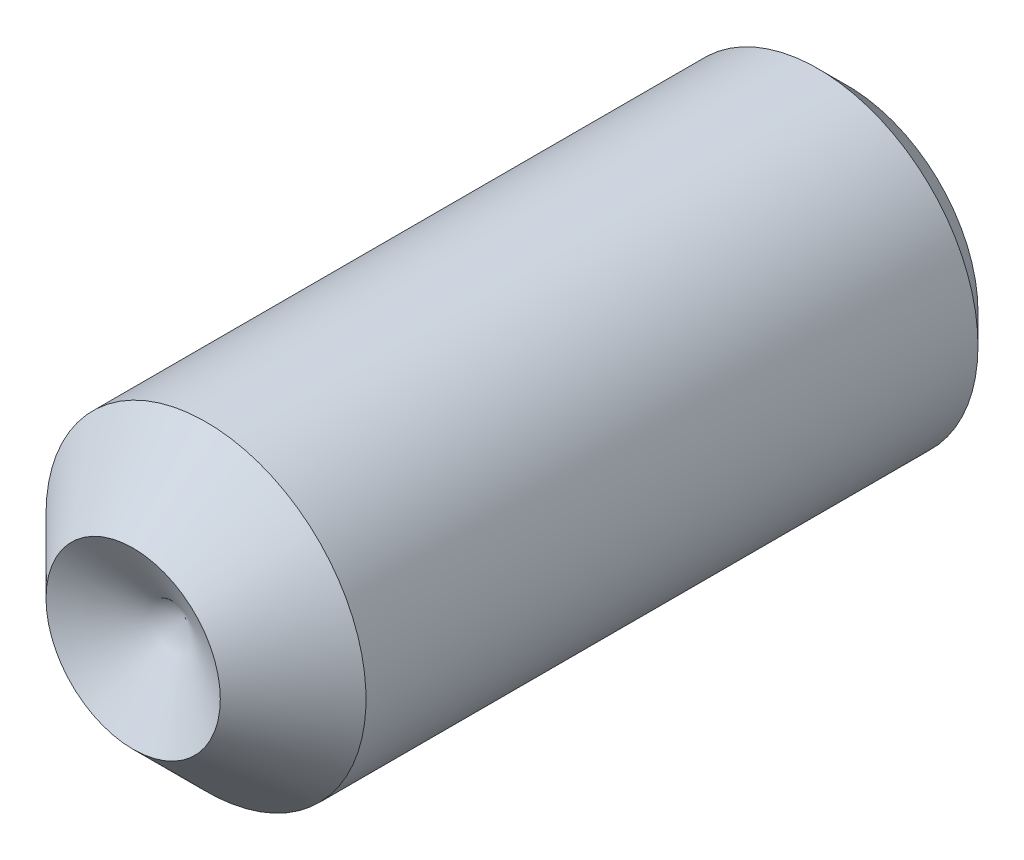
ISO-10303-21;
HEADER;
FILE_DESCRIPTION(('STEP AP214'),'2;1');
FILE_NAME('part.step','',(''),(''),'','','');
FILE_SCHEMA(('AUTOMOTIVE_DESIGN { 1 0 10303 214 1 1 1 1 }'));
ENDSEC;
DATA;
#1=APPLICATION_CONTEXT('core data for automotive mechanical design processes');
#2=APPLICATION_PROTOCOL_DEFINITION('international standard','automotive_design',2000,#1);
#3=PRODUCT_CONTEXT('',#1,'mechanical');
#4=PRODUCT('Part','Part','',(#3));
#5=PRODUCT_RELATED_PRODUCT_CATEGORY('part','',(#4));
#6=PRODUCT_DEFINITION_FORMATION('','',#4);
#7=PRODUCT_DEFINITION_CONTEXT('part definition',#1,'design');
#8=PRODUCT_DEFINITION('design','',#6,#7);
#9=PRODUCT_DEFINITION_SHAPE('','',#8);
#10=(LENGTH_UNIT() NAMED_UNIT(*) SI_UNIT(.MILLI.,.METRE.));
#11=(NAMED_UNIT(*) PLANE_ANGLE_UNIT() SI_UNIT($,.RADIAN.));
#12=(NAMED_UNIT(*) SI_UNIT($,.STERADIAN.) SOLID_ANGLE_UNIT());
#13=UNCERTAINTY_MEASURE_WITH_UNIT(LENGTH_MEASURE(1.E-05),#10,'distance_accuracy_value','');
#14=(GEOMETRIC_REPRESENTATION_CONTEXT(3) GLOBAL_UNCERTAINTY_ASSIGNED_CONTEXT((#13)) GLOBAL_UNIT_ASSIGNED_CONTEXT((#10,
#11,#12)) REPRESENTATION_CONTEXT('',''));
#15=CARTESIAN_POINT('',(0.,0.,0.));
#16=DIRECTION('',(0.,0.,1.));
#17=DIRECTION('',(1.,0.,0.));
#18=AXIS2_PLACEMENT_3D('',#15,#16,#17);
#19=CARTESIAN_POINT('',(0.,0.,6.34999999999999));
#20=DIRECTION('',(0.,0.,-0.999999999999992));
#21=DIRECTION('',(-1.,0.,0.));
#22=AXIS2_PLACEMENT_3D('',#19,#20,#21);
#23=CYLINDRICAL_SURFACE('',#22,1.4224);
#24=CARTESIAN_POINT('',(0.,0.,0.262466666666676));
#25=DIRECTION('',(0.,0.,0.999999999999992));
#26=DIRECTION('',(1.,0.,0.));
#27=AXIS2_PLACEMENT_3D('',#24,#25,#26);
#28=CIRCLE('',#27,1.4224);
#29=CARTESIAN_POINT('',(-1.42239999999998,0.,0.262466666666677));
#30=VERTEX_POINT('',#29);
#31=EDGE_CURVE('E43',#30,#30,#28,.T.);
#32=CARTESIAN_POINT('',(0.,0.,5.70229999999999));
#33=DIRECTION('',(0.,0.,-0.999999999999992));
#34=DIRECTION('',(-1.,0.,0.));
#35=AXIS2_PLACEMENT_3D('',#32,#33,#34);
#36=CIRCLE('',#35,1.4224);
#37=CARTESIAN_POINT('',(-1.42239999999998,0.,5.70229999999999));
#38=VERTEX_POINT('',#37);
#39=EDGE_CURVE('E145',#38,#38,#36,.T.);
#40=CARTESIAN_POINT('',(-1.42239999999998,0.,0.262466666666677));
#41=CARTESIAN_POINT('',(-1.42239999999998,0.,0.319131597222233));
#42=CARTESIAN_POINT('',(-1.42239999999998,0.,0.375796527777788));
#43=CARTESIAN_POINT('',(-1.42239999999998,0.,0.489126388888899));
#44=CARTESIAN_POINT('',(-1.42239999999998,0.,0.545791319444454));
#45=CARTESIAN_POINT('',(-1.42239999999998,0.,0.659121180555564));
#46=CARTESIAN_POINT('',(-1.42239999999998,0.,0.71578611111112));
#47=CARTESIAN_POINT('',(-1.42239999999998,0.,0.829115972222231));
#48=CARTESIAN_POINT('',(-1.42239999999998,0.,0.885780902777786));
#49=CARTESIAN_POINT('',(-1.42239999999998,0.,0.999110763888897));
#50=CARTESIAN_POINT('',(-1.42239999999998,0.,1.05577569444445));
#51=CARTESIAN_POINT('',(-1.42239999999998,0.,1.16910555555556));
#52=CARTESIAN_POINT('',(-1.42239999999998,0.,1.22577048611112));
#53=CARTESIAN_POINT('',(-1.42239999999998,0.,1.33910034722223));
#54=CARTESIAN_POINT('',(-1.42239999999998,0.,1.39576527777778));
#55=CARTESIAN_POINT('',(-1.42239999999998,0.,1.5090951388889));
#56=CARTESIAN_POINT('',(-1.42239999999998,0.,1.56576006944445));
#57=CARTESIAN_POINT('',(-1.42239999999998,0.,1.67908993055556));
#58=CARTESIAN_POINT('',(-1.42239999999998,0.,1.73575486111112));
#59=CARTESIAN_POINT('',(-1.42239999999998,0.,1.84908472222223));
#60=CARTESIAN_POINT('',(-1.42239999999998,0.,1.90574965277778));
#61=CARTESIAN_POINT('',(-1.42239999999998,0.,2.01907951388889));
#62=CARTESIAN_POINT('',(-1.42239999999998,0.,2.07574444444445));
#63=CARTESIAN_POINT('',(-1.42239999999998,0.,2.18907430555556));
#64=CARTESIAN_POINT('',(-1.42239999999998,0.,2.24573923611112));
#65=CARTESIAN_POINT('',(-1.42239999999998,0.,2.35906909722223));
#66=CARTESIAN_POINT('',(-1.42239999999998,0.,2.41573402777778));
#67=CARTESIAN_POINT('',(-1.42239999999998,0.,2.52906388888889));
#68=CARTESIAN_POINT('',(-1.42239999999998,0.,2.58572881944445));
#69=CARTESIAN_POINT('',(-1.42239999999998,0.,2.69905868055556));
#70=CARTESIAN_POINT('',(-1.42239999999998,0.,2.75572361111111));
#71=CARTESIAN_POINT('',(-1.42239999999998,0.,2.86905347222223));
#72=CARTESIAN_POINT('',(-1.42239999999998,0.,2.92571840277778));
#73=CARTESIAN_POINT('',(-1.42239999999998,0.,3.03904826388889));
#74=CARTESIAN_POINT('',(-1.42239999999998,0.,3.09571319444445));
#75=CARTESIAN_POINT('',(-1.42239999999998,0.,3.20904305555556));
#76=CARTESIAN_POINT('',(-1.42239999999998,0.,3.26570798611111));
#77=CARTESIAN_POINT('',(-1.42239999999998,0.,3.37903784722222));
#78=CARTESIAN_POINT('',(-1.42239999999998,0.,3.43570277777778));
#79=CARTESIAN_POINT('',(-1.42239999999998,0.,3.54903263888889));
#80=CARTESIAN_POINT('',(-1.42239999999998,0.,3.60569756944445));
#81=CARTESIAN_POINT('',(-1.42239999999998,0.,3.71902743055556));
#82=CARTESIAN_POINT('',(-1.42239999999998,0.,3.77569236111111));
#83=CARTESIAN_POINT('',(-1.42239999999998,0.,3.88902222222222));
#84=CARTESIAN_POINT('',(-1.42239999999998,0.,3.94568715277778));
#85=CARTESIAN_POINT('',(-1.42239999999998,0.,4.05901701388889));
#86=CARTESIAN_POINT('',(-1.42239999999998,0.,4.11568194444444));
#87=CARTESIAN_POINT('',(-1.42239999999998,0.,4.22901180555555));
#88=CARTESIAN_POINT('',(-1.42239999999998,0.,4.28567673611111));
#89=CARTESIAN_POINT('',(-1.42239999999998,0.,4.39900659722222));
#90=CARTESIAN_POINT('',(-1.42239999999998,0.,4.45567152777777));
#91=CARTESIAN_POINT('',(-1.42239999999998,0.,4.56900138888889));
#92=CARTESIAN_POINT('',(-1.42239999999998,0.,4.62566631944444));
#93=CARTESIAN_POINT('',(-1.42239999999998,0.,4.73899618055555));
#94=CARTESIAN_POINT('',(-1.42239999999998,0.,4.79566111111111));
#95=CARTESIAN_POINT('',(-1.42239999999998,0.,4.90899097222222));
#96=CARTESIAN_POINT('',(-1.42239999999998,0.,4.96565590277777));
#97=CARTESIAN_POINT('',(-1.42239999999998,0.,5.07898576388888));
#98=CARTESIAN_POINT('',(-1.42239999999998,0.,5.13565069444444));
#99=CARTESIAN_POINT('',(-1.42239999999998,0.,5.24898055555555));
#100=CARTESIAN_POINT('',(-1.42239999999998,0.,5.30564548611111));
#101=CARTESIAN_POINT('',(-1.42239999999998,0.,5.41897534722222));
#102=CARTESIAN_POINT('',(-1.42239999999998,0.,5.47564027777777));
#103=CARTESIAN_POINT('',(-1.42239999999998,0.,5.58897013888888));
#104=CARTESIAN_POINT('',(-1.42239999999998,0.,5.64563506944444));
#105=CARTESIAN_POINT('',(-1.42239999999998,0.,5.70229999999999));
#106=B_SPLINE_CURVE_WITH_KNOTS('',3,(#40,#41,#42,#43,#44,#45,#46,#47,#48,#49,#50,#51,#52,#53,
#54,#55,#56,#57,#58,#59,#60,#61,#62,#63,#64,#65,#66,#67,#68,#69,#70,#71,#72,#73,#74,#75,#76,#77,
#78,#79,#80,#81,#82,#83,#84,#85,#86,#87,#88,#89,#90,#91,#92,#93,#94,#95,#96,#97,#98,#99,#100,
#101,#102,#103,#104,#105),.UNSPECIFIED.,.F.,.F.,(4,2,2,2,2,2,2,2,2,2,2,2,2,2,2,2,2,2,2,2,2,2,2,
2,2,2,2,2,2,2,2,2,4),(0.,0.169994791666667,0.339989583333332,0.509984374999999,
0.679979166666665,0.849973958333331,1.01996875,1.18996354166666,1.35995833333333,1.529953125,
1.69994791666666,1.86994270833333,2.03993749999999,2.20993229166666,2.37992708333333,
2.54992187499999,2.71991666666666,2.88991145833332,3.05990624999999,3.22990104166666,
3.39989583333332,3.56989062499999,3.73988541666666,3.90988020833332,4.07987499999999,
4.24986979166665,4.41986458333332,4.58985937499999,4.75985416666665,4.92984895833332,
5.09984374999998,5.26983854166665,5.43983333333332),.UNSPECIFIED.);
#107=EDGE_CURVE('BSEAM36',#30,#38,#106,.T.);
#108=ORIENTED_EDGE('',*,*,#31,.T.);
#109=ORIENTED_EDGE('',*,*,#39,.T.);
#110=ORIENTED_EDGE('',*,*,#107,.T.);
#111=ORIENTED_EDGE('',*,*,#107,.F.);
#112=EDGE_LOOP('',(#108,#110,#109,#111));
#113=FACE_BOUND('',#112,.T.);
#114=ADVANCED_FACE('F36',(#113),#23,.T.);
#115=CARTESIAN_POINT('',(0.,0.,0.));
#116=DIRECTION('',(0.,0.,0.999999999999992));
#117=DIRECTION('',(1.,0.,0.));
#118=AXIS2_PLACEMENT_3D('',#115,#116,#117);
#119=PLANE('',#118);
#120=CARTESIAN_POINT('',(0.,0.,0.));
#121=DIRECTION('',(0.,0.,0.999999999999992));
#122=DIRECTION('',(1.,0.,0.));
#123=AXIS2_PLACEMENT_3D('',#120,#121,#122);
#124=CIRCLE('',#123,1.15993333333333);
#125=CARTESIAN_POINT('',(1.15993333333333,0.,0.));
#126=VERTEX_POINT('',#125);
#127=EDGE_CURVE('E11',#126,#126,#124,.F.);
#128=ORIENTED_EDGE('',*,*,#127,.T.);
#129=EDGE_LOOP('',(#128));
#130=FACE_BOUND('',#129,.T.);
#131=DIRECTION('',(-0.866025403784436,-0.499999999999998,0.));
#132=VECTOR('',#131,1.);
#133=CARTESIAN_POINT('',(0.,0.733234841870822,0.));
#134=LINE('',#133,#132);
#135=CARTESIAN_POINT('',(0.,0.733234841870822,0.));
#136=VERTEX_POINT('',#135);
#137=CARTESIAN_POINT('',(-0.635000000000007,0.366617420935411,0.));
#138=VERTEX_POINT('',#137);
#139=EDGE_CURVE('E104',#136,#138,#134,.T.);
#140=ORIENTED_EDGE('',*,*,#139,.T.);
#141=DIRECTION('',(0.,0.999999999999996,0.));
#142=VECTOR('',#141,1.);
#143=CARTESIAN_POINT('',(-0.635000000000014,-0.366617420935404,0.));
#144=LINE('',#143,#142);
#145=CARTESIAN_POINT('',(-0.635000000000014,-0.366617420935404,0.));
#146=VERTEX_POINT('',#145);
#147=EDGE_CURVE('E50',#146,#138,#144,.T.);
#148=ORIENTED_EDGE('',*,*,#147,.F.);
#149=DIRECTION('',(-0.866025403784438,0.5,0.));
#150=VECTOR('',#149,1.);
#151=CARTESIAN_POINT('',(0.,-0.733234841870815,0.));
#152=LINE('',#151,#150);
#153=CARTESIAN_POINT('',(0.,-0.733234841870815,0.));
#154=VERTEX_POINT('',#153);
#155=EDGE_CURVE('E118',#154,#146,#152,.T.);
#156=ORIENTED_EDGE('',*,*,#155,.F.);
#157=DIRECTION('',(0.866025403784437,0.499999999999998,0.));
#158=VECTOR('',#157,1.);
#159=CARTESIAN_POINT('',(0.,-0.733234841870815,0.));
#160=LINE('',#159,#158);
#161=CARTESIAN_POINT('',(0.634999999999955,-0.36661742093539,0.));
#162=VERTEX_POINT('',#161);
#163=EDGE_CURVE('E113',#154,#162,#160,.T.);
#164=ORIENTED_EDGE('',*,*,#163,.T.);
#165=DIRECTION('',(0.,0.999999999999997,0.));
#166=VECTOR('',#165,1.);
#167=CARTESIAN_POINT('',(0.634999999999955,-0.36661742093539,0.));
#168=LINE('',#167,#166);
#169=CARTESIAN_POINT('',(0.634999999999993,0.366617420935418,0.));
#170=VERTEX_POINT('',#169);
#171=EDGE_CURVE('E111',#162,#170,#168,.T.);
#172=ORIENTED_EDGE('',*,*,#171,.T.);
#173=DIRECTION('',(0.866025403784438,-0.5,0.));
#174=VECTOR('',#173,1.);
#175=CARTESIAN_POINT('',(0.,0.733234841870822,0.));
#176=LINE('',#175,#174);
#177=EDGE_CURVE('E94',#136,#170,#176,.T.);
#178=ORIENTED_EDGE('',*,*,#177,.F.);
#179=EDGE_LOOP('',(#140,#148,#156,#164,#172,#178));
#180=FACE_BOUND('',#179,.T.);
#181=ADVANCED_FACE('F108',(#130,#180),#119,.F.);
#182=CARTESIAN_POINT('',(0.,0.,6.34999999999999));
#183=DIRECTION('',(0.,0.,-0.999999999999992));
#184=DIRECTION('',(-1.,0.,0.));
#185=AXIS2_PLACEMENT_3D('',#182,#183,#184);
#186=CONICAL_SURFACE('',#185,0.7747,0.785398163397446);
#187=CARTESIAN_POINT('',(0.,0.,6.34999999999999));
#188=DIRECTION('',(0.,0.,-0.999999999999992));
#189=DIRECTION('',(-1.,0.,0.));
#190=AXIS2_PLACEMENT_3D('',#187,#188,#189);
#191=CIRCLE('',#190,0.7747);
#192=CARTESIAN_POINT('',(-0.774699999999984,0.,6.34999999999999));
#193=VERTEX_POINT('',#192);
#194=EDGE_CURVE('E136',#193,#193,#191,.T.);
#195=CARTESIAN_POINT('',(-1.42239999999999,0.,5.70229999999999));
#196=CARTESIAN_POINT('',(-1.41565312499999,0.,5.70904687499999));
#197=CARTESIAN_POINT('',(-1.40890624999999,0.,5.71579374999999));
#198=CARTESIAN_POINT('',(-1.39541249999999,0.,5.72928749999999));
#199=CARTESIAN_POINT('',(-1.38866562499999,0.,5.73603437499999));
#200=CARTESIAN_POINT('',(-1.37517187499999,0.,5.74952812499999));
#201=CARTESIAN_POINT('',(-1.36842499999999,0.,5.756275));
#202=CARTESIAN_POINT('',(-1.35493124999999,0.,5.76976874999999));
#203=CARTESIAN_POINT('',(-1.34818437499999,0.,5.77651562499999));
#204=CARTESIAN_POINT('',(-1.33469062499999,0.,5.79000937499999));
#205=CARTESIAN_POINT('',(-1.32794374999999,0.,5.79675625));
#206=CARTESIAN_POINT('',(-1.31444999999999,0.,5.81024999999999));
#207=CARTESIAN_POINT('',(-1.30770312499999,0.,5.81699687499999));
#208=CARTESIAN_POINT('',(-1.29420937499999,0.,5.83049062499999));
#209=CARTESIAN_POINT('',(-1.28746249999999,0.,5.8372375));
#210=CARTESIAN_POINT('',(-1.27396874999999,0.,5.85073124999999));
#211=CARTESIAN_POINT('',(-1.26722187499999,0.,5.85747812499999));
#212=CARTESIAN_POINT('',(-1.25372812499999,0.,5.87097187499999));
#213=CARTESIAN_POINT('',(-1.24698124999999,0.,5.87771875));
#214=CARTESIAN_POINT('',(-1.23348749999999,0.,5.89121249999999));
#215=CARTESIAN_POINT('',(-1.22674062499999,0.,5.89795937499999));
#216=CARTESIAN_POINT('',(-1.21324687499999,0.,5.91145312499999));
#217=CARTESIAN_POINT('',(-1.20649999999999,0.,5.9182));
#218=CARTESIAN_POINT('',(-1.19300624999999,0.,5.93169374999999));
#219=CARTESIAN_POINT('',(-1.18625937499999,0.,5.93844062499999));
#220=CARTESIAN_POINT('',(-1.17276562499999,0.,5.95193437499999));
#221=CARTESIAN_POINT('',(-1.16601874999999,0.,5.95868125));
#222=CARTESIAN_POINT('',(-1.15252499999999,0.,5.97217499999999));
#223=CARTESIAN_POINT('',(-1.14577812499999,0.,5.97892187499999));
#224=CARTESIAN_POINT('',(-1.13228437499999,0.,5.99241562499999));
#225=CARTESIAN_POINT('',(-1.12553749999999,0.,5.9991625));
#226=CARTESIAN_POINT('',(-1.11204374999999,0.,6.01265624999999));
#227=CARTESIAN_POINT('',(-1.10529687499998,0.,6.01940312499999));
#228=CARTESIAN_POINT('',(-1.09180312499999,0.,6.03289687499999));
#229=CARTESIAN_POINT('',(-1.08505624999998,0.,6.03964375));
#230=CARTESIAN_POINT('',(-1.07156249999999,0.,6.05313749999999));
#231=CARTESIAN_POINT('',(-1.06481562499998,0.,6.05988437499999));
#232=CARTESIAN_POINT('',(-1.05132187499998,0.,6.07337812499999));
#233=CARTESIAN_POINT('',(-1.04457499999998,0.,6.080125));
#234=CARTESIAN_POINT('',(-1.03108124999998,0.,6.09361874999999));
#235=CARTESIAN_POINT('',(-1.02433437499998,0.,6.10036562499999));
#236=CARTESIAN_POINT('',(-1.01084062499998,0.,6.11385937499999));
#237=CARTESIAN_POINT('',(-1.00409374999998,0.,6.12060625));
#238=CARTESIAN_POINT('',(-0.990599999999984,0.,6.13409999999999));
#239=CARTESIAN_POINT('',(-0.983853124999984,0.,6.14084687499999));
#240=CARTESIAN_POINT('',(-0.970359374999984,0.,6.15434062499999));
#241=CARTESIAN_POINT('',(-0.963612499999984,0.,6.16108749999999));
#242=CARTESIAN_POINT('',(-0.950118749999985,0.,6.17458125));
#243=CARTESIAN_POINT('',(-0.943371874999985,0.,6.181328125));
#244=CARTESIAN_POINT('',(-0.929878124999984,0.,6.194821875));
#245=CARTESIAN_POINT('',(-0.923131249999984,0.,6.20156874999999));
#246=CARTESIAN_POINT('',(-0.909637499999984,0.,6.21506249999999));
#247=CARTESIAN_POINT('',(-0.902890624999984,0.,6.22180937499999));
#248=CARTESIAN_POINT('',(-0.889396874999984,0.,6.235303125));
#249=CARTESIAN_POINT('',(-0.882649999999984,0.,6.24205));
#250=CARTESIAN_POINT('',(-0.869156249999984,0.,6.25554374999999));
#251=CARTESIAN_POINT('',(-0.862409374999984,0.,6.262290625));
#252=CARTESIAN_POINT('',(-0.848915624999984,0.,6.275784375));
#253=CARTESIAN_POINT('',(-0.842168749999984,0.,6.28253124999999));
#254=CARTESIAN_POINT('',(-0.828674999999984,0.,6.29602499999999));
#255=CARTESIAN_POINT('',(-0.821928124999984,0.,6.302771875));
#256=CARTESIAN_POINT('',(-0.808434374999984,0.,6.31626562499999));
#257=CARTESIAN_POINT('',(-0.801687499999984,0.,6.32301249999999));
#258=CARTESIAN_POINT('',(-0.788193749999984,0.,6.33650624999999));
#259=CARTESIAN_POINT('',(-0.781446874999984,0.,6.343253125));
#260=CARTESIAN_POINT('',(-0.774699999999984,0.,6.34999999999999));
#261=B_SPLINE_CURVE_WITH_KNOTS('',3,(#195,#196,#197,#198,#199,#200,#201,#202,#203,#204,#205,
#206,#207,#208,#209,#210,#211,#212,#213,#214,#215,#216,#217,#218,#219,#220,#221,#222,#223,#224,
#225,#226,#227,#228,#229,#230,#231,#232,#233,#234,#235,#236,#237,#238,#239,#240,#241,#242,#243,
#244,#245,#246,#247,#248,#249,#250,#251,#252,#253,#254,#255,#256,#257,#258,#259,#260),
.UNSPECIFIED.,.F.,.F.,(4,2,2,2,2,2,2,2,2,2,2,2,2,2,2,2,2,2,2,2,2,2,2,2,2,2,2,2,2,2,2,2,4),(0.,
0.028624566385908,0.0572491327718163,0.0858736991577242,0.114498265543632,0.14312283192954,
0.171747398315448,0.200371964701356,0.228996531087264,0.257621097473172,0.28624566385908,
0.314870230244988,0.343494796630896,0.372119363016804,0.400743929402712,0.429368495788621,
0.457993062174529,0.486617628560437,0.515242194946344,0.543866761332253,0.572491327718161,
0.601115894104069,0.629740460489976,0.658365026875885,0.686989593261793,0.7156141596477,
0.744238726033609,0.772863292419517,0.801487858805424,0.830112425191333,0.85873699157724,
0.887361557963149,0.915986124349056),.UNSPECIFIED.);
#262=EDGE_CURVE('BSEAM167',#38,#193,#261,.T.);
#263=ORIENTED_EDGE('',*,*,#39,.F.);
#264=ORIENTED_EDGE('',*,*,#194,.T.);
#265=ORIENTED_EDGE('',*,*,#262,.T.);
#266=ORIENTED_EDGE('',*,*,#262,.F.);
#267=EDGE_LOOP('',(#263,#265,#264,#266));
#268=FACE_BOUND('',#267,.T.);
#269=ADVANCED_FACE('F167',(#268),#186,.T.);
#270=CARTESIAN_POINT('',(0.,0.,5.88451327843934));
#271=DIRECTION('',(0.,0.,0.999999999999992));
#272=DIRECTION('',(1.,0.,0.));
#273=AXIS2_PLACEMENT_3D('',#270,#271,#272);
#274=CONICAL_SURFACE('',#273,0.,1.02974425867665);
#275=ORIENTED_EDGE('',*,*,#194,.F.);
#276=EDGE_LOOP('',(#275));
#277=FACE_BOUND('',#276,.T.);
#278=CARTESIAN_POINT('',(0.,0.,5.88451327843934));
#279=VERTEX_POINT('',#278);
#280=VERTEX_LOOP('',#279);
#281=FACE_BOUND('',#280,.T.);
#282=ADVANCED_FACE('F172',(#277,#281),#274,.F.);
#283=CARTESIAN_POINT('',(-0.635000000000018,-0.36661742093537,1.27));
#284=DIRECTION('',(-0.999999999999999,0.,0.));
#285=DIRECTION('',(0.,-0.999999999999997,0.));
#286=AXIS2_PLACEMENT_3D('',#283,#284,#285);
#287=PLANE('',#286);
#288=ORIENTED_EDGE('',*,*,#147,.T.);
#289=DIRECTION('',(0.,0.,-0.999999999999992));
#290=VECTOR('',#289,1.);
#291=CARTESIAN_POINT('',(-0.635000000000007,0.366617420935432,1.27));
#292=LINE('',#291,#290);
#293=CARTESIAN_POINT('',(-0.635000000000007,0.366617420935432,1.27));
#294=VERTEX_POINT('',#293);
#295=EDGE_CURVE('E101',#294,#138,#292,.T.);
#296=ORIENTED_EDGE('',*,*,#295,.F.);
#297=DIRECTION('',(0.,0.999999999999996,0.));
#298=VECTOR('',#297,1.);
#299=CARTESIAN_POINT('',(-0.635000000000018,-0.36661742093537,1.27));
#300=LINE('',#299,#298);
#301=CARTESIAN_POINT('',(-0.635000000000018,-0.36661742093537,1.27));
#302=VERTEX_POINT('',#301);
#303=EDGE_CURVE('E121',#302,#294,#300,.T.);
#304=ORIENTED_EDGE('',*,*,#303,.F.);
#305=DIRECTION('',(0.,0.,-0.999999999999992));
#306=VECTOR('',#305,1.);
#307=CARTESIAN_POINT('',(-0.635000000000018,-0.36661742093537,1.27));
#308=LINE('',#307,#306);
#309=EDGE_CURVE('E134',#302,#146,#308,.T.);
#310=ORIENTED_EDGE('',*,*,#309,.T.);
#311=EDGE_LOOP('',(#288,#296,#304,#310));
#312=FACE_BOUND('',#311,.T.);
#313=ADVANCED_FACE('F178',(#312),#287,.F.);
#314=CARTESIAN_POINT('',(0.,-0.733234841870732,1.27));
#315=DIRECTION('',(-0.499999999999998,-0.866025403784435,0.));
#316=DIRECTION('',(0.866025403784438,-0.5,0.));
#317=AXIS2_PLACEMENT_3D('',#314,#315,#316);
#318=PLANE('',#317);
#319=ORIENTED_EDGE('',*,*,#155,.T.);
#320=ORIENTED_EDGE('',*,*,#309,.F.);
#321=DIRECTION('',(-0.866025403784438,0.5,0.));
#322=VECTOR('',#321,1.);
#323=CARTESIAN_POINT('',(0.,-0.733234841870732,1.27));
#324=LINE('',#323,#322);
#325=CARTESIAN_POINT('',(0.,-0.733234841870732,1.27));
#326=VERTEX_POINT('',#325);
#327=EDGE_CURVE('E131',#326,#302,#324,.T.);
#328=ORIENTED_EDGE('',*,*,#327,.F.);
#329=DIRECTION('',(0.,0.,-0.999999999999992));
#330=VECTOR('',#329,1.);
#331=CARTESIAN_POINT('',(0.,-0.733234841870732,1.27));
#332=LINE('',#331,#330);
#333=EDGE_CURVE('E137',#326,#154,#332,.T.);
#334=ORIENTED_EDGE('',*,*,#333,.T.);
#335=EDGE_LOOP('',(#319,#320,#328,#334));
#336=FACE_BOUND('',#335,.T.);
#337=ADVANCED_FACE('F182',(#336),#318,.F.);
#338=CARTESIAN_POINT('',(0.,-0.733234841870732,1.27));
#339=DIRECTION('',(-0.500000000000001,0.866025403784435,0.));
#340=DIRECTION('',(-0.866025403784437,-0.499999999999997,0.));
#341=AXIS2_PLACEMENT_3D('',#338,#339,#340);
#342=PLANE('',#341);
#343=ORIENTED_EDGE('',*,*,#163,.F.);
#344=ORIENTED_EDGE('',*,*,#333,.F.);
#345=DIRECTION('',(0.866025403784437,0.499999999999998,0.));
#346=VECTOR('',#345,1.);
#347=CARTESIAN_POINT('',(0.,-0.733234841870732,1.27));
#348=LINE('',#347,#346);
#349=CARTESIAN_POINT('',(0.634999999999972,-0.366617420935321,1.27000000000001));
#350=VERTEX_POINT('',#349);
#351=EDGE_CURVE('E129',#326,#350,#348,.T.);
#352=ORIENTED_EDGE('',*,*,#351,.T.);
#353=DIRECTION('',(0.,0.,-0.999999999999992));
#354=VECTOR('',#353,1.);
#355=CARTESIAN_POINT('',(0.634999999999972,-0.366617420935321,1.27000000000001));
#356=LINE('',#355,#354);
#357=EDGE_CURVE('E139',#350,#162,#356,.T.);
#358=ORIENTED_EDGE('',*,*,#357,.T.);
#359=EDGE_LOOP('',(#343,#344,#352,#358));
#360=FACE_BOUND('',#359,.T.);
#361=ADVANCED_FACE('F190',(#360),#342,.T.);
#362=CARTESIAN_POINT('',(0.634999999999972,-0.366617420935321,1.27000000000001));
#363=DIRECTION('',(-1.,0.,0.));
#364=DIRECTION('',(0.,-0.999999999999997,0.));
#365=AXIS2_PLACEMENT_3D('',#362,#363,#364);
#366=PLANE('',#365);
#367=ORIENTED_EDGE('',*,*,#171,.F.);
#368=ORIENTED_EDGE('',*,*,#357,.F.);
#369=DIRECTION('',(0.,0.999999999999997,0.));
#370=VECTOR('',#369,1.);
#371=CARTESIAN_POINT('',(0.634999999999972,-0.366617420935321,1.27000000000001));
#372=LINE('',#371,#370);
#373=CARTESIAN_POINT('',(0.634999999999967,0.366617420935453,1.26999999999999));
#374=VERTEX_POINT('',#373);
#375=EDGE_CURVE('E127',#350,#374,#372,.T.);
#376=ORIENTED_EDGE('',*,*,#375,.T.);
#377=DIRECTION('',(0.,0.,-0.999999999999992));
#378=VECTOR('',#377,1.);
#379=CARTESIAN_POINT('',(0.634999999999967,0.366617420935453,1.26999999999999));
#380=LINE('',#379,#378);
#381=EDGE_CURVE('E100',#374,#170,#380,.T.);
#382=ORIENTED_EDGE('',*,*,#381,.T.);
#383=EDGE_LOOP('',(#367,#368,#376,#382));
#384=FACE_BOUND('',#383,.T.);
#385=ADVANCED_FACE('F187',(#384),#366,.T.);
#386=CARTESIAN_POINT('',(0.,0.733234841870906,1.27));
#387=DIRECTION('',(0.499999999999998,0.866025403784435,0.));
#388=DIRECTION('',(-0.866025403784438,0.5,0.));
#389=AXIS2_PLACEMENT_3D('',#386,#387,#388);
#390=PLANE('',#389);
#391=ORIENTED_EDGE('',*,*,#177,.T.);
#392=ORIENTED_EDGE('',*,*,#381,.F.);
#393=DIRECTION('',(0.866025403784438,-0.5,0.));
#394=VECTOR('',#393,1.);
#395=CARTESIAN_POINT('',(0.,0.733234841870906,1.27));
#396=LINE('',#395,#394);
#397=CARTESIAN_POINT('',(0.,0.733234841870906,1.27));
#398=VERTEX_POINT('',#397);
#399=EDGE_CURVE('E97',#398,#374,#396,.T.);
#400=ORIENTED_EDGE('',*,*,#399,.F.);
#401=DIRECTION('',(0.,0.,-0.999999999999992));
#402=VECTOR('',#401,1.);
#403=CARTESIAN_POINT('',(0.,0.733234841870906,1.27));
#404=LINE('',#403,#402);
#405=EDGE_CURVE('E89',#398,#136,#404,.T.);
#406=ORIENTED_EDGE('',*,*,#405,.T.);
#407=EDGE_LOOP('',(#391,#392,#400,#406));
#408=FACE_BOUND('',#407,.T.);
#409=ADVANCED_FACE('F91',(#408),#390,.F.);
#410=CARTESIAN_POINT('',(0.,0.733234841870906,1.27));
#411=DIRECTION('',(0.500000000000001,-0.866025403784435,0.));
#412=DIRECTION('',(0.866025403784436,0.499999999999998,0.));
#413=AXIS2_PLACEMENT_3D('',#410,#411,#412);
#414=PLANE('',#413);
#415=ORIENTED_EDGE('',*,*,#139,.F.);
#416=ORIENTED_EDGE('',*,*,#405,.F.);
#417=DIRECTION('',(-0.866025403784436,-0.499999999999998,0.));
#418=VECTOR('',#417,1.);
#419=CARTESIAN_POINT('',(0.,0.733234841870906,1.27));
#420=LINE('',#419,#418);
#421=EDGE_CURVE('E124',#398,#294,#420,.T.);
#422=ORIENTED_EDGE('',*,*,#421,.T.);
#423=ORIENTED_EDGE('',*,*,#295,.T.);
#424=EDGE_LOOP('',(#415,#416,#422,#423));
#425=FACE_BOUND('',#424,.T.);
#426=ADVANCED_FACE('F105',(#425),#414,.T.);
#427=CARTESIAN_POINT('',(-0.63500000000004,1.09985226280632,1.26999999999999));
#428=DIRECTION('',(0.,0.,-0.999999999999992));
#429=DIRECTION('',(-1.,0.,0.));
#430=AXIS2_PLACEMENT_3D('',#427,#428,#429);
#431=PLANE('',#430);
#432=ORIENTED_EDGE('',*,*,#303,.T.);
#433=ORIENTED_EDGE('',*,*,#421,.F.);
#434=ORIENTED_EDGE('',*,*,#399,.T.);
#435=ORIENTED_EDGE('',*,*,#375,.F.);
#436=ORIENTED_EDGE('',*,*,#351,.F.);
#437=ORIENTED_EDGE('',*,*,#327,.T.);
#438=EDGE_LOOP('',(#432,#433,#434,#435,#436,#437));
#439=FACE_BOUND('',#438,.T.);
#440=ADVANCED_FACE('F154',(#439),#431,.T.);
#441=CARTESIAN_POINT('',(0.,0.,0.262466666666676));
#442=DIRECTION('',(0.,0.,0.999999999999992));
#443=DIRECTION('',(1.,0.,0.));
#444=AXIS2_PLACEMENT_3D('',#441,#442,#443);
#445=CONICAL_SURFACE('',#444,1.4224,0.785398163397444);
#446=ORIENTED_EDGE('',*,*,#127,.F.);
#447=EDGE_LOOP('',(#446));
#448=FACE_BOUND('',#447,.T.);
#449=ORIENTED_EDGE('',*,*,#31,.F.);
#450=EDGE_LOOP('',(#449));
#451=FACE_BOUND('',#450,.T.);
#452=ADVANCED_FACE('F152',(#448,#451),#445,.T.);
#453=CLOSED_SHELL('',(#114,#181,#269,#282,#313,#337,#361,#385,#409,#426,#440,#452));
#454=MANIFOLD_SOLID_BREP('B2',#453);
#455=ADVANCED_BREP_SHAPE_REPRESENTATION('',(#18,#454),#14);
#456=SHAPE_DEFINITION_REPRESENTATION(#9,#455);
ENDSEC;
END-ISO-10303-21;
